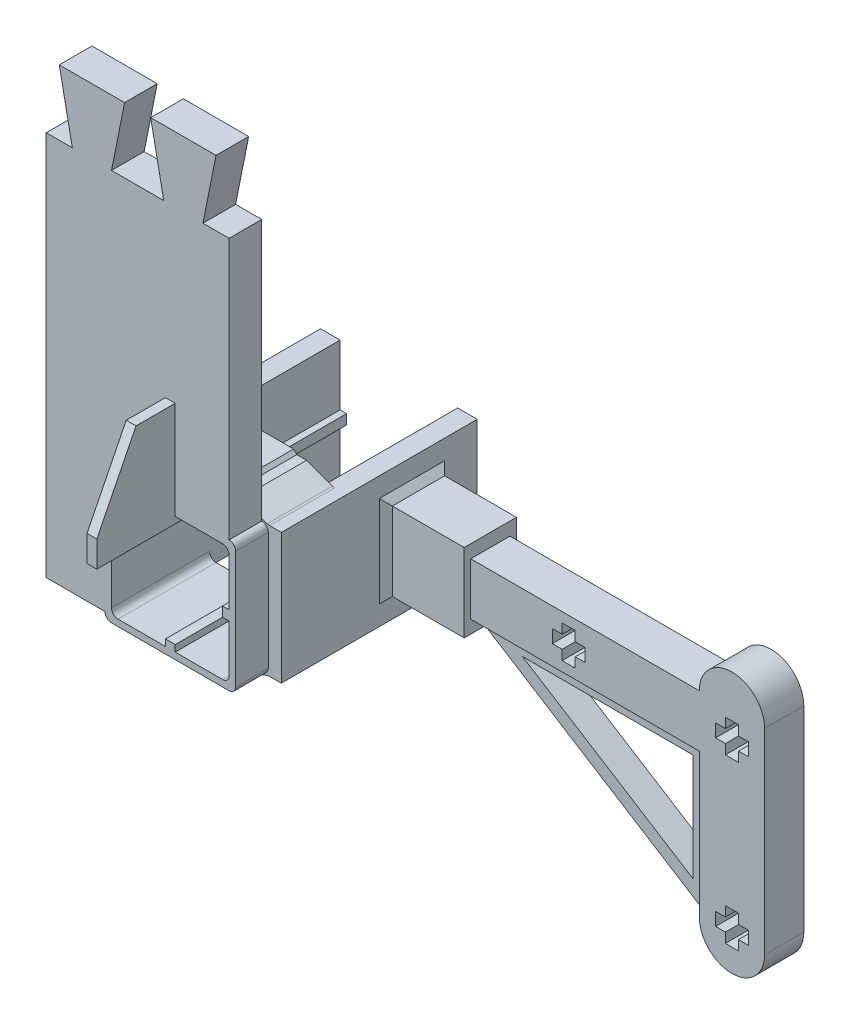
from build123d import *

# Parameters (mm, degrees)
SKETCH_1_W                 = 20
SKETCH_1_H                 = 20
SKETCH_1_W_2               = 18
SKETCH_1_H_2               = 18
EXTRUDE_1_DEPTH            = 10
SKETCH_2_W                 = 2
SKETCH_2_H                 = 20
EXTRUDE_2_DEPTH            = 10
SKETCH_3_W                 = 3
SKETCH_3_H                 = 20
EXTRUDE_3_DEPTH            = 20
FILLET_1_R                 = 1
SKETCH_4_W                 = 1.5
SKETCH_4_H                 = 2
SKETCH_4_W_2               = 2
SKETCH_4_H_2               = 1.5
EXTRUDE_4_DEPTH            = 10
SKETCH_5_W                 = 12
SKETCH_5_H                 = 12
EXTRUDE_8_DEPTH            = 4
SKETCH_8_W                 = 6
SKETCH_8_H                 = 8
EXTRUDE_9_DEPTH            = 35
EXTRUDE_10_DEPTH           = 3
CHAMFER_1_SIZE             = 1
RIB_1_REACH                = 80.243
SKETCH_10_WALL_W           = 199.826474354
SKETCH_10_WALL_H           = 4
CUT_EXTRUDE_1_DEPTH        = 79.243210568
CUT_EXTRUDE_1_DEPTH_BACK   = 79.243210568
EXTRUDE_START              = 5
EXTRUDE_11_DEPTH           = 5
SKETCH_14_W                = 18
SKETCH_14_H                = 5
EXTRUDE_12_DEPTH           = 50
EXTRUDE_13_DEPTH           = 5
CUT_EXTRUDE_6_DEPTH        = 5
SKETCH_18_W                = 1
SKETCH_18_H                = 1.5
EXTRUDE_15_DEPTH           = 20
CUT_EXTRUDE_7_DEPTH        = 95.047860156
PATTERN_LINEAR_1_COUNT     = 2
PATTERN_LINEAR_1_PITCH     = 25
PATTERN_LINEAR_1_COL_COUNT = 2
PATTERN_LINEAR_1_COL_PITCH = 25
SKETCH_20_W                = 1.5
SKETCH_20_H                = 1
SKETCH_20_W_2              = 1
SKETCH_20_H_2              = 1.5
EXTRUDE_16_DEPTH           = 5
EXTRUDE_18_DEPTH           = 1.5
SKETCH_22_W                = 1
SKETCH_22_H                = 1.5
EXTRUDE_19_DEPTH           = 20


with BuildPart() as part:
    # Sketch 1 → Extrude 1 (new body)
    # profile 1 of 4: a face of its own
    with BuildSketch(Plane.XY):
        Polygon((-10, 10), (-5.878783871, 11.5), (-4.378783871, 11.5), (-3.878783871, 12), (3.878783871, 12), (4.378783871, 11.5), (5.878783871, 11.5), (10, 10), align=None)
    # profile 2 of 4: a face of its own
    with BuildSketch(Plane.XY):
        Rectangle(SKETCH_1_W, SKETCH_1_H)
        Rectangle(SKETCH_1_W_2, SKETCH_1_H_2, mode=Mode.SUBTRACT)
    # profile 3 of 4: a face of its own
    with BuildSketch(Plane.XY):
        Polygon((10, -10), (5.878783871, -11.5), (4.378783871, -11.5), (3.878783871, -12), (-3.878783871, -12), (-4.378783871, -11.5), (-5.878783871, -11.5), (-10, -10), align=None)
    # profile 4 of 4: a face of its own
    with BuildSketch(Plane.XY):
        Polygon((-10, -10), (-11.5, -5.878783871), (-11.5, -4.378783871), (-12, -3.878783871), (-12, 3.878783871), (-11.5, 4.378783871), (-11.5, 5.878783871), (-10, 10), align=None)
    extrude(amount=EXTRUDE_1_DEPTH)

    # Sketch 2 → Extrude 2 (add)
    with BuildSketch(Plane(origin=(0, 0, 0), x_dir=(-1, 0, 0), z_dir=(0, 0, -1))):
        with Locations((-11, 0)):
            Rectangle(SKETCH_2_W, SKETCH_2_H)
    extrude_2 = extrude(amount=-EXTRUDE_2_DEPTH)

    # Sketch 3 → Extrude 3 (add)
    with BuildSketch(Plane(origin=(0, 0, 0), x_dir=(-1, 0, 0), z_dir=(0, 0, -1))):
        with Locations((-10.5, 0)):
            Rectangle(SKETCH_3_W, SKETCH_3_H)
    extrude_3 = extrude(amount=EXTRUDE_3_DEPTH)

    # Fillet 1
    fillet_1_edges = [part.edges().sort_by_distance(p)[0] for p in [
        (-9, -9, 5),
        (9, -9, 5),
        (9, 9, 5),
        (-9, 9, 5),
        (10, 10, 5),
        (10, -10, 5),
        (-10, -10, 5),
        (-10, 10, 5),
    ]]
    fillet(fillet_1_edges, radius=FILLET_1_R)

    # Sketch 4 → Extrude 4 (add)
    with BuildSketch(Plane(origin=(0, 0, 0), x_dir=(-1, 0, 0), z_dir=(0, 0, -1))):
        with Locations((0, 9)):
            Rectangle(SKETCH_4_W, SKETCH_4_H)
        with Locations((9, 0)):
            Rectangle(SKETCH_4_W_2, SKETCH_4_H_2)
        with Locations((0, -9)):
            Rectangle(SKETCH_4_W, SKETCH_4_H)
        with Locations((-9, 0)):
            Rectangle(SKETCH_4_W_2, SKETCH_4_H_2)
    extrude(amount=-EXTRUDE_4_DEPTH)

    # Sketch 5 → Extrude 8 (add, symmetric)
    with BuildSketch(Plane(origin=(0, 0, -10), x_dir=(-1, 0, 0), z_dir=(0, 0, -1))):
        with Locations((-18, 0)):
            Rectangle(SKETCH_5_W, SKETCH_5_H)
    extrude(amount=EXTRUDE_8_DEPTH, both=True)

    # Sketch 8 → Extrude 9 (add)
    with BuildSketch(Plane(origin=(24, 0, 0), x_dir=(0, 0, -1), z_dir=(1, 0, 0))):
        with Locations((10, 0)):
            Rectangle(SKETCH_8_W, SKETCH_8_H)
    extrude(amount=EXTRUDE_9_DEPTH)

    # Sketch 9 → Extrude 10 (add, symmetric)
    with BuildSketch(Plane(origin=(0, 0, -10), x_dir=(-1, 0, 0), z_dir=(0, 0, -1))):
        with BuildLine():
            Line((-59, 4), (-59, -26))
            ThreePointArc((-59, -26), (-64, -31), (-69, -26))
            Line((-69, -26), (-69, 4))
            ThreePointArc((-69, 4), (-64, 9), (-59, 4))
        make_face()
    extrude(amount=EXTRUDE_10_DEPTH, both=True)

    # Chamfer 1
    chamfer_1_edges = [part.edges().sort_by_distance(p)[0] for p in [
        (12, 0, -6),
        (12, -6, -10),
        (12, 6, -10),
        (12, 0, -14),
    ]]
    chamfer(chamfer_1_edges, length=CHAMFER_1_SIZE)

    # Sketch 10 wall → Rib 1 (add, up to next)
    with BuildSketch(Plane(origin=(41.5, -15, -10), x_dir=(0.846636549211, -0.532171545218, 0), z_dir=(-0.532171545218, -0.846636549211, 0)), mode=Mode.PRIVATE) as rib_1_sk1:
        Rectangle(SKETCH_10_WALL_W, SKETCH_10_WALL_H)
    rib_1_tool1 = extrude(rib_1_sk1.sketch, amount=-RIB_1_REACH, mode=Mode.PRIVATE) - part.part
    add(rib_1_tool1.solids().sort_by_distance((41.5, -15, -10))[0])

    # Sketch 11 → Cut-Extrude 1 (cut, two sides: drawn at the far end of the back side and taken through both)
    with BuildSketch(Plane(origin=(0, 0, -10), x_dir=(-1, 0, 0), z_dir=(0, 0, -1)).offset(-CUT_EXTRUDE_1_DEPTH_BACK)):
        Polygon((-57, -6), (-57, -22.380568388), (-30.940004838, -6), align=None)
    extrude(amount=CUT_EXTRUDE_1_DEPTH + CUT_EXTRUDE_1_DEPTH_BACK, mode=Mode.SUBTRACT)

    # Sketch 13 → Extrude 11 (add)
    with BuildSketch(Plane.XY.offset(10).offset(EXTRUDE_START)):
        with BuildLine():
            Line((9, 10), (-9, 10))
            ThreePointArc((-9, 10), (-9.707106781, 9.707106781), (-10, 9))
            Line((-10, 9), (-10, -9))
            ThreePointArc((-10, -9), (-9.707106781, -9.707106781), (-9, -10))
            Line((-9, -10), (9, -10))
            ThreePointArc((9, -10), (9.707106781, -9.707106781), (10, -9))
            Line((10, -9), (10, 9))
            ThreePointArc((10, 9), (9.707106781, 9.707106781), (9, 10))
        make_face()
        with BuildLine():
            Line((8, 9), (-8, 9))
            ThreePointArc((-8, 9), (-8.707106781, 8.707106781), (-9, 8))
            Line((-9, 8), (-9, -8))
            ThreePointArc((-9, -8), (-8.707106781, -8.707106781), (-8, -9))
            Line((-8, -9), (8, -9))
            ThreePointArc((8, -9), (8.707106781, -8.707106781), (9, -8))
            Line((9, -8), (9, 8))
            ThreePointArc((9, 8), (8.707106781, 8.707106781), (8, 9))
        make_face(mode=Mode.SUBTRACT)
    extrude(amount=-EXTRUDE_11_DEPTH)

    # Sketch 14 → Extrude 12 (add)
    with BuildSketch(Plane(origin=(0, 10, 0), x_dir=(1, 0, 0), z_dir=(0, 1, 0))):
        with Locations((0, -12.5)):
            Rectangle(SKETCH_14_W, SKETCH_14_H)
    extrude(amount=EXTRUDE_12_DEPTH)

    # Sketch 15 → Extrude 13 (add)
    with BuildSketch(Plane.XY.offset(15)):
        with BuildLine():
            Line((-9, 60), (-9, 10))
            ThreePointArc((-9, 10), (-9.707106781, 9.707106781), (-10, 9))
            Line((-10, 9), (-10, -9))
            Line((-10, -9), (-19, -9))
            Line((-19, -9), (-19, 60))
            Line((-19, 60), (-9, 60))
        make_face()
    extrude(amount=-EXTRUDE_13_DEPTH)

    # Sketch 17 → Cut-Extrude 6 (cut)
    with BuildSketch(Plane.XY.offset(15)):
        Polygon((-17, 60), (-19, 60), (-19, 50), (-15, 50), align=None)
        Polygon((-5, 60), (-7, 60), (-9, 50), (-5, 50), align=None)
        Polygon((-3, 60), (-5, 60), (-5, 50), (-1, 50), align=None)
        Polygon((9, 60), (7, 60), (5, 50), (9, 50), align=None)
    extrude(amount=-CUT_EXTRUDE_6_DEPTH, mode=Mode.SUBTRACT)

    # Sketch 18 → Extrude 15 (add)
    with BuildSketch(Plane(origin=(0, 0, 0), x_dir=(-1, 0, 0), z_dir=(0, 0, -1))):
        with Locations((-8.5, 0)):
            Rectangle(SKETCH_18_W, SKETCH_18_H)
    extrude(amount=EXTRUDE_15_DEPTH)

    # Sketch 19 → Cut-Extrude 7 (cut, symmetric)
    with BuildSketch(Plane.XY.offset(-7)):
        Polygon((65, 1), (65, 2.5), (63, 2.5), (63, 1), (61.5, 1), (61.5, -1), (63, -1), (63, -2.5), (65, -2.5), (65, -1), (66.5, -1), (66.5, 1), align=None)
    cut_extrude_7 = extrude(amount=CUT_EXTRUDE_7_DEPTH, both=True, mode=Mode.SUBTRACT)

    # Pattern Linear 1: Cut-Extrude 7 ×2
    with Locations(*[(-i * PATTERN_LINEAR_1_PITCH, 0, 0) for i in range(1, PATTERN_LINEAR_1_COUNT)]):
        add(cut_extrude_7, mode=Mode.SUBTRACT)

    # Pattern Linear 1 col: Cut-Extrude 7 ×2
    with Locations(*[(0, -i * PATTERN_LINEAR_1_COL_PITCH, 0) for i in range(1, PATTERN_LINEAR_1_COL_COUNT)]):
        add(cut_extrude_7, mode=Mode.SUBTRACT)

    # Sketch 20 → Extrude 16 (add)
    with BuildSketch(Plane.XY.offset(10)):
        with Locations((0, -8.5)):
            Rectangle(SKETCH_20_W, SKETCH_20_H)
        with Locations((-8.5, 0)):
            Rectangle(SKETCH_20_W_2, SKETCH_20_H_2)
        with Locations((0, 8.5)):
            Rectangle(SKETCH_20_W, SKETCH_20_H)
        with Locations((8.5, 0)):
            Rectangle(SKETCH_20_W_2, SKETCH_20_H_2)
    extrude(amount=EXTRUDE_16_DEPTH)

    # Sketch 21 → Extrude 18 (add)
    with BuildSketch(Plane.ZY.offset(0.75)):
        Polygon((15, 8), (27, 8), (27, 12), (21, 24), (15, 24), align=None)
    extrude(amount=-EXTRUDE_18_DEPTH)

    # Mirror 1: Extrude 2, Extrude 3 across plane
    add(extrude_2.mirror(Plane(origin=(0, 0, 0), x_dir=(0, 0, 1), z_dir=(1, 0, 0))))
    add(extrude_3.mirror(Plane(origin=(0, 0, 0), x_dir=(0, 0, 1), z_dir=(1, 0, 0))))

    # Sketch 22 → Extrude 19 (add)
    with BuildSketch(Plane(origin=(0, 0, 0), x_dir=(-1, 0, 0), z_dir=(0, 0, -1))):
        with Locations((8.5, 0)):
            Rectangle(SKETCH_22_W, SKETCH_22_H)
    extrude(amount=EXTRUDE_19_DEPTH)


solid = part.part
